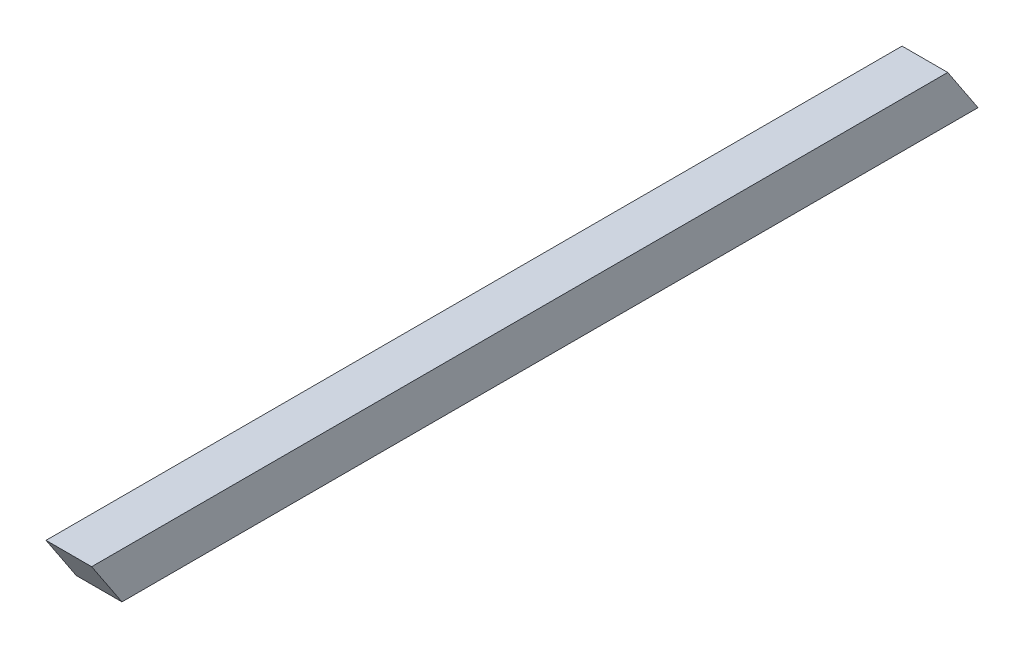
ISO-10303-21;
HEADER;
FILE_DESCRIPTION(('STEP AP214'),'2;1');
FILE_NAME('part.step','',(''),(''),'','','');
FILE_SCHEMA(('AUTOMOTIVE_DESIGN { 1 0 10303 214 1 1 1 1 }'));
ENDSEC;
DATA;
#1=APPLICATION_CONTEXT('core data for automotive mechanical design processes');
#2=APPLICATION_PROTOCOL_DEFINITION('international standard','automotive_design',2000,#1);
#3=PRODUCT_CONTEXT('',#1,'mechanical');
#4=PRODUCT('Part','Part','',(#3));
#5=PRODUCT_RELATED_PRODUCT_CATEGORY('part','',(#4));
#6=PRODUCT_DEFINITION_FORMATION('','',#4);
#7=PRODUCT_DEFINITION_CONTEXT('part definition',#1,'design');
#8=PRODUCT_DEFINITION('design','',#6,#7);
#9=PRODUCT_DEFINITION_SHAPE('','',#8);
#10=(LENGTH_UNIT() NAMED_UNIT(*) SI_UNIT(.MILLI.,.METRE.));
#11=(NAMED_UNIT(*) PLANE_ANGLE_UNIT() SI_UNIT($,.RADIAN.));
#12=(NAMED_UNIT(*) SI_UNIT($,.STERADIAN.) SOLID_ANGLE_UNIT());
#13=UNCERTAINTY_MEASURE_WITH_UNIT(LENGTH_MEASURE(1.E-05),#10,'distance_accuracy_value','');
#14=(GEOMETRIC_REPRESENTATION_CONTEXT(3) GLOBAL_UNCERTAINTY_ASSIGNED_CONTEXT((#13)) GLOBAL_UNIT_ASSIGNED_CONTEXT((#10,
#11,#12)) REPRESENTATION_CONTEXT('',''));
#15=CARTESIAN_POINT('',(0.,0.,0.));
#16=DIRECTION('',(0.,0.,1.));
#17=DIRECTION('',(1.,0.,0.));
#18=AXIS2_PLACEMENT_3D('',#15,#16,#17);
#19=CARTESIAN_POINT('',(-2.,2.,37.5));
#20=DIRECTION('',(1.,0.,0.));
#21=DIRECTION('',(0.,0.,-1.));
#22=AXIS2_PLACEMENT_3D('',#19,#20,#21);
#23=PLANE('',#22);
#24=DIRECTION('',(0.,0.,-1.));
#25=VECTOR('',#24,1.);
#26=CARTESIAN_POINT('',(-2.,2.,37.5));
#27=LINE('',#26,#25);
#28=CARTESIAN_POINT('',(-2.,2.,40.1532998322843));
#29=VERTEX_POINT('',#28);
#30=CARTESIAN_POINT('',(-2.,2.,-34.8467001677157));
#31=VERTEX_POINT('',#30);
#32=EDGE_CURVE('E66',#29,#31,#27,.T.);
#33=ORIENTED_EDGE('',*,*,#32,.T.);
#34=DIRECTION('',(0.,0.833333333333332,0.552770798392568));
#35=VECTOR('',#34,1.);
#36=CARTESIAN_POINT('',(-2.,-2.,-37.5));
#37=LINE('',#36,#35);
#38=CARTESIAN_POINT('',(-2.,-2.,-37.5));
#39=VERTEX_POINT('',#38);
#40=EDGE_CURVE('E84',#39,#31,#37,.T.);
#41=ORIENTED_EDGE('',*,*,#40,.F.);
#42=DIRECTION('',(0.,0.,-1.));
#43=VECTOR('',#42,1.);
#44=CARTESIAN_POINT('',(-2.,-2.,37.5));
#45=LINE('',#44,#43);
#46=CARTESIAN_POINT('',(-2.,-2.,37.5));
#47=VERTEX_POINT('',#46);
#48=EDGE_CURVE('E11',#47,#39,#45,.T.);
#49=ORIENTED_EDGE('',*,*,#48,.F.);
#50=DIRECTION('',(0.,0.833333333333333,0.552770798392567));
#51=VECTOR('',#50,1.);
#52=CARTESIAN_POINT('',(-2.,2.,40.1532998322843));
#53=LINE('',#52,#51);
#54=EDGE_CURVE('E81',#47,#29,#53,.T.);
#55=ORIENTED_EDGE('',*,*,#54,.T.);
#56=EDGE_LOOP('',(#33,#41,#49,#55));
#57=FACE_BOUND('',#56,.T.);
#58=ADVANCED_FACE('F27',(#57),#23,.F.);
#59=CARTESIAN_POINT('',(-2.,-2.,37.5));
#60=DIRECTION('',(0.,1.,0.));
#61=DIRECTION('',(0.,0.,1.));
#62=AXIS2_PLACEMENT_3D('',#59,#60,#61);
#63=PLANE('',#62);
#64=DIRECTION('',(1.,0.,0.));
#65=VECTOR('',#64,1.);
#66=CARTESIAN_POINT('',(-2.,-2.,-37.5));
#67=LINE('',#66,#65);
#68=CARTESIAN_POINT('',(2.,-2.,-37.5));
#69=VERTEX_POINT('',#68);
#70=EDGE_CURVE('E94',#39,#69,#67,.T.);
#71=ORIENTED_EDGE('',*,*,#70,.T.);
#72=DIRECTION('',(0.,0.,-1.));
#73=VECTOR('',#72,1.);
#74=CARTESIAN_POINT('',(2.,-2.,37.5));
#75=LINE('',#74,#73);
#76=CARTESIAN_POINT('',(2.,-2.,37.5));
#77=VERTEX_POINT('',#76);
#78=EDGE_CURVE('E34',#77,#69,#75,.T.);
#79=ORIENTED_EDGE('',*,*,#78,.F.);
#80=DIRECTION('',(1.,0.,0.));
#81=VECTOR('',#80,1.);
#82=CARTESIAN_POINT('',(-2.,-2.,37.5));
#83=LINE('',#82,#81);
#84=EDGE_CURVE('E43',#47,#77,#83,.T.);
#85=ORIENTED_EDGE('',*,*,#84,.F.);
#86=ORIENTED_EDGE('',*,*,#48,.T.);
#87=EDGE_LOOP('',(#71,#79,#85,#86));
#88=FACE_BOUND('',#87,.T.);
#89=ADVANCED_FACE('F101',(#88),#63,.F.);
#90=CARTESIAN_POINT('',(2.,2.,37.5));
#91=DIRECTION('',(-1.,0.,0.));
#92=DIRECTION('',(0.,-1.,0.));
#93=AXIS2_PLACEMENT_3D('',#90,#91,#92);
#94=PLANE('',#93);
#95=ORIENTED_EDGE('',*,*,#78,.T.);
#96=DIRECTION('',(0.,0.833333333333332,0.552770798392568));
#97=VECTOR('',#96,1.);
#98=CARTESIAN_POINT('',(1.99999999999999,35.3259526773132,-12.740764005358));
#99=LINE('',#98,#97);
#100=CARTESIAN_POINT('',(2.,2.,-34.8467001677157));
#101=VERTEX_POINT('',#100);
#102=EDGE_CURVE('E91',#69,#101,#99,.T.);
#103=ORIENTED_EDGE('',*,*,#102,.T.);
#104=DIRECTION('',(0.,0.,-1.));
#105=VECTOR('',#104,1.);
#106=CARTESIAN_POINT('',(2.,2.,37.5));
#107=LINE('',#106,#105);
#108=CARTESIAN_POINT('',(2.,2.,40.1532998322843));
#109=VERTEX_POINT('',#108);
#110=EDGE_CURVE('E76',#109,#101,#107,.T.);
#111=ORIENTED_EDGE('',*,*,#110,.F.);
#112=DIRECTION('',(0.,0.833333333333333,0.552770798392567));
#113=VECTOR('',#112,1.);
#114=CARTESIAN_POINT('',(2.,2.,40.1532998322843));
#115=LINE('',#114,#113);
#116=EDGE_CURVE('E83',#77,#109,#115,.T.);
#117=ORIENTED_EDGE('',*,*,#116,.F.);
#118=EDGE_LOOP('',(#95,#103,#111,#117));
#119=FACE_BOUND('',#118,.T.);
#120=ADVANCED_FACE('F98',(#119),#94,.F.);
#121=CARTESIAN_POINT('',(-2.,2.,37.5));
#122=DIRECTION('',(0.,-1.,0.));
#123=DIRECTION('',(1.,0.,0.));
#124=AXIS2_PLACEMENT_3D('',#121,#122,#123);
#125=PLANE('',#124);
#126=ORIENTED_EDGE('',*,*,#110,.T.);
#127=DIRECTION('',(-1.,0.,0.));
#128=VECTOR('',#127,1.);
#129=CARTESIAN_POINT('',(298.,2.,-34.8467001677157));
#130=LINE('',#129,#128);
#131=EDGE_CURVE('E72',#101,#31,#130,.T.);
#132=ORIENTED_EDGE('',*,*,#131,.T.);
#133=ORIENTED_EDGE('',*,*,#32,.F.);
#134=DIRECTION('',(-1.,0.,0.));
#135=VECTOR('',#134,1.);
#136=CARTESIAN_POINT('',(2.,2.,40.1532998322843));
#137=LINE('',#136,#135);
#138=EDGE_CURVE('E70',#109,#29,#137,.T.);
#139=ORIENTED_EDGE('',*,*,#138,.F.);
#140=EDGE_LOOP('',(#126,#132,#133,#139));
#141=FACE_BOUND('',#140,.T.);
#142=ADVANCED_FACE('F69',(#141),#125,.F.);
#143=CARTESIAN_POINT('',(298.,-2.,-37.5));
#144=DIRECTION('',(0.,-0.552770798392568,0.833333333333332));
#145=DIRECTION('',(0.,-0.833333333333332,-0.552770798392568));
#146=AXIS2_PLACEMENT_3D('',#143,#144,#145);
#147=PLANE('',#146);
#148=ORIENTED_EDGE('',*,*,#70,.F.);
#149=ORIENTED_EDGE('',*,*,#40,.T.);
#150=ORIENTED_EDGE('',*,*,#131,.F.);
#151=ORIENTED_EDGE('',*,*,#102,.F.);
#152=EDGE_LOOP('',(#148,#149,#150,#151));
#153=FACE_BOUND('',#152,.T.);
#154=ADVANCED_FACE('F100',(#153),#147,.F.);
#155=CARTESIAN_POINT('',(2.,2.,40.1532998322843));
#156=DIRECTION('',(0.,-0.552770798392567,0.833333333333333));
#157=DIRECTION('',(0.,-0.833333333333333,-0.552770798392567));
#158=AXIS2_PLACEMENT_3D('',#155,#156,#157);
#159=PLANE('',#158);
#160=ORIENTED_EDGE('',*,*,#54,.F.);
#161=ORIENTED_EDGE('',*,*,#84,.T.);
#162=ORIENTED_EDGE('',*,*,#116,.T.);
#163=ORIENTED_EDGE('',*,*,#138,.T.);
#164=EDGE_LOOP('',(#160,#161,#162,#163));
#165=FACE_BOUND('',#164,.T.);
#166=ADVANCED_FACE('F80',(#165),#159,.T.);
#167=CLOSED_SHELL('',(#58,#89,#120,#142,#154,#166));
#168=MANIFOLD_SOLID_BREP('B2',#167);
#169=ADVANCED_BREP_SHAPE_REPRESENTATION('',(#18,#168),#14);
#170=SHAPE_DEFINITION_REPRESENTATION(#9,#169);
ENDSEC;
END-ISO-10303-21;
